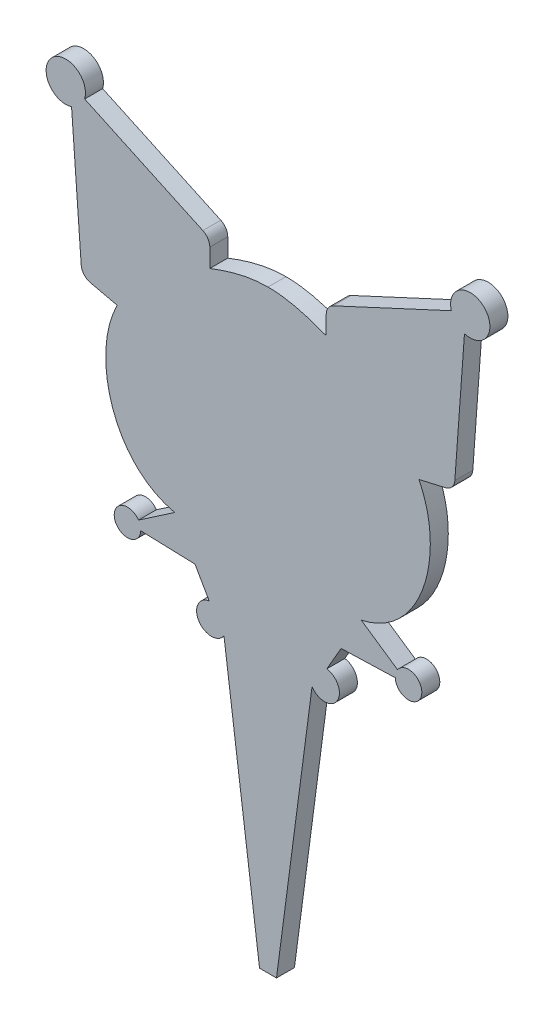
ISO-10303-21;
HEADER;
FILE_DESCRIPTION(('STEP AP214'),'2;1');
FILE_NAME('part.step','',(''),(''),'','','');
FILE_SCHEMA(('AUTOMOTIVE_DESIGN { 1 0 10303 214 1 1 1 1 }'));
ENDSEC;
DATA;
#1=APPLICATION_CONTEXT('core data for automotive mechanical design processes');
#2=APPLICATION_PROTOCOL_DEFINITION('international standard','automotive_design',2000,#1);
#3=PRODUCT_CONTEXT('',#1,'mechanical');
#4=PRODUCT('Part','Part','',(#3));
#5=PRODUCT_RELATED_PRODUCT_CATEGORY('part','',(#4));
#6=PRODUCT_DEFINITION_FORMATION('','',#4);
#7=PRODUCT_DEFINITION_CONTEXT('part definition',#1,'design');
#8=PRODUCT_DEFINITION('design','',#6,#7);
#9=PRODUCT_DEFINITION_SHAPE('','',#8);
#10=(LENGTH_UNIT() NAMED_UNIT(*) SI_UNIT(.MILLI.,.METRE.));
#11=(NAMED_UNIT(*) PLANE_ANGLE_UNIT() SI_UNIT($,.RADIAN.));
#12=(NAMED_UNIT(*) SI_UNIT($,.STERADIAN.) SOLID_ANGLE_UNIT());
#13=UNCERTAINTY_MEASURE_WITH_UNIT(LENGTH_MEASURE(1.E-05),#10,'distance_accuracy_value','');
#14=(GEOMETRIC_REPRESENTATION_CONTEXT(3) GLOBAL_UNCERTAINTY_ASSIGNED_CONTEXT((#13)) GLOBAL_UNIT_ASSIGNED_CONTEXT((#10,
#11,#12)) REPRESENTATION_CONTEXT('',''));
#15=CARTESIAN_POINT('',(0.,0.,0.));
#16=DIRECTION('',(0.,0.,1.));
#17=DIRECTION('',(1.,0.,0.));
#18=AXIS2_PLACEMENT_3D('',#15,#16,#17);
#19=CARTESIAN_POINT('',(108.12807029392,242.914945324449,12.));
#20=DIRECTION('',(0.,0.,-1.));
#21=DIRECTION('',(-1.,0.,0.));
#22=AXIS2_PLACEMENT_3D('',#19,#20,#21);
#23=CYLINDRICAL_SURFACE('',#22,8.);
#24=CARTESIAN_POINT('',(108.12807029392,242.914945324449,0.));
#25=DIRECTION('',(0.,0.,1.));
#26=DIRECTION('',(1.,0.,0.));
#27=AXIS2_PLACEMENT_3D('',#24,#25,#26);
#28=CIRCLE('',#27,8.);
#29=CARTESIAN_POINT('',(116.12807029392,242.914945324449,0.));
#30=VERTEX_POINT('',#29);
#31=CARTESIAN_POINT('',(111.496400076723,250.171277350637,0.));
#32=VERTEX_POINT('',#31);
#33=EDGE_CURVE('E292',#30,#32,#28,.T.);
#34=ORIENTED_EDGE('',*,*,#33,.T.);
#35=DIRECTION('',(0.,0.,-1.));
#36=VECTOR('',#35,1.);
#37=CARTESIAN_POINT('',(111.496400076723,250.171277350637,12.));
#38=LINE('',#37,#36);
#39=CARTESIAN_POINT('',(111.496400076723,250.171277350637,12.));
#40=VERTEX_POINT('',#39);
#41=EDGE_CURVE('E11',#40,#32,#38,.T.);
#42=ORIENTED_EDGE('',*,*,#41,.F.);
#43=CARTESIAN_POINT('',(108.12807029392,242.914945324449,12.));
#44=DIRECTION('',(0.,0.,1.));
#45=DIRECTION('',(1.,0.,0.));
#46=AXIS2_PLACEMENT_3D('',#43,#44,#45);
#47=CIRCLE('',#46,8.);
#48=CARTESIAN_POINT('',(116.12807029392,242.914945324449,12.));
#49=VERTEX_POINT('',#48);
#50=EDGE_CURVE('E293',#49,#40,#47,.T.);
#51=ORIENTED_EDGE('',*,*,#50,.F.);
#52=DIRECTION('',(0.,0.,-1.));
#53=VECTOR('',#52,1.);
#54=CARTESIAN_POINT('',(116.12807029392,242.914945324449,12.));
#55=LINE('',#54,#53);
#56=EDGE_CURVE('E471',#49,#30,#55,.T.);
#57=ORIENTED_EDGE('',*,*,#56,.T.);
#58=EDGE_LOOP('',(#34,#42,#51,#57));
#59=FACE_BOUND('',#58,.T.);
#60=ADVANCED_FACE('F45',(#59),#23,.T.);
#61=CARTESIAN_POINT('',(32.5783061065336,286.804408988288,12.));
#62=DIRECTION('',(-0.421041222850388,-0.907041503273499,0.));
#63=DIRECTION('',(0.9070415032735,-0.421041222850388,0.));
#64=AXIS2_PLACEMENT_3D('',#61,#62,#63);
#65=PLANE('',#64);
#66=DIRECTION('',(-0.9070415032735,0.421041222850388,0.));
#67=VECTOR('',#66,1.);
#68=CARTESIAN_POINT('',(32.5783061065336,286.804408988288,0.));
#69=LINE('',#68,#67);
#70=CARTESIAN_POINT('',(32.5783061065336,286.804408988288,0.));
#71=VERTEX_POINT('',#70);
#72=EDGE_CURVE('E355',#32,#71,#69,.T.);
#73=ORIENTED_EDGE('',*,*,#72,.T.);
#74=DIRECTION('',(0.,0.,-1.));
#75=VECTOR('',#74,1.);
#76=CARTESIAN_POINT('',(32.5783061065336,286.804408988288,12.));
#77=LINE('',#76,#75);
#78=CARTESIAN_POINT('',(32.5783061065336,286.804408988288,12.));
#79=VERTEX_POINT('',#78);
#80=EDGE_CURVE('E53',#79,#71,#77,.T.);
#81=ORIENTED_EDGE('',*,*,#80,.F.);
#82=DIRECTION('',(-0.9070415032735,0.421041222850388,0.));
#83=VECTOR('',#82,1.);
#84=CARTESIAN_POINT('',(32.5783061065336,286.804408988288,12.));
#85=LINE('',#84,#83);
#86=EDGE_CURVE('E297',#40,#79,#85,.T.);
#87=ORIENTED_EDGE('',*,*,#86,.F.);
#88=ORIENTED_EDGE('',*,*,#41,.T.);
#89=EDGE_LOOP('',(#73,#81,#87,#88));
#90=FACE_BOUND('',#89,.T.);
#91=ADVANCED_FACE('F346',(#90),#65,.F.);
#92=CARTESIAN_POINT('',(19.9741027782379,290.474625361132,12.));
#93=DIRECTION('',(0.,0.,-1.));
#94=DIRECTION('',(-1.,0.,0.));
#95=AXIS2_PLACEMENT_3D('',#92,#93,#94);
#96=CYLINDRICAL_SURFACE('',#95,13.1276970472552);
#97=CARTESIAN_POINT('',(19.9741027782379,290.474625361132,0.));
#98=DIRECTION('',(0.,0.,1.));
#99=DIRECTION('',(1.,0.,0.));
#100=AXIS2_PLACEMENT_3D('',#97,#98,#99);
#101=CIRCLE('',#100,13.1276970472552);
#102=CARTESIAN_POINT('',(23.8301965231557,277.926040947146,0.));
#103=VERTEX_POINT('',#102);
#104=EDGE_CURVE('E364',#71,#103,#101,.T.);
#105=ORIENTED_EDGE('',*,*,#104,.T.);
#106=DIRECTION('',(0.,0.,-1.));
#107=VECTOR('',#106,1.);
#108=CARTESIAN_POINT('',(23.8301965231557,277.926040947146,12.));
#109=LINE('',#108,#107);
#110=CARTESIAN_POINT('',(23.8301965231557,277.926040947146,12.));
#111=VERTEX_POINT('',#110);
#112=EDGE_CURVE('E369',#111,#103,#109,.T.);
#113=ORIENTED_EDGE('',*,*,#112,.F.);
#114=CARTESIAN_POINT('',(19.9741027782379,290.474625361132,12.));
#115=DIRECTION('',(0.,0.,1.));
#116=DIRECTION('',(1.,0.,0.));
#117=AXIS2_PLACEMENT_3D('',#114,#115,#116);
#118=CIRCLE('',#117,13.1276970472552);
#119=EDGE_CURVE('E301',#79,#111,#118,.T.);
#120=ORIENTED_EDGE('',*,*,#119,.F.);
#121=ORIENTED_EDGE('',*,*,#80,.T.);
#122=EDGE_LOOP('',(#105,#113,#120,#121));
#123=FACE_BOUND('',#122,.T.);
#124=ADVANCED_FACE('F343',(#123),#96,.T.);
#125=CARTESIAN_POINT('',(23.8301965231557,277.926040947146,12.));
#126=DIRECTION('',(0.997351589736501,0.0727310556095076,0.));
#127=DIRECTION('',(-0.0727310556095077,0.997351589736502,0.));
#128=AXIS2_PLACEMENT_3D('',#125,#126,#127);
#129=PLANE('',#128);
#130=DIRECTION('',(0.0727310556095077,-0.997351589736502,0.));
#131=VECTOR('',#130,1.);
#132=CARTESIAN_POINT('',(23.8301965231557,277.926040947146,0.));
#133=LINE('',#132,#131);
#134=CARTESIAN_POINT('',(30.2646972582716,189.690561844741,0.));
#135=VERTEX_POINT('',#134);
#136=EDGE_CURVE('E373',#103,#135,#133,.T.);
#137=ORIENTED_EDGE('',*,*,#136,.T.);
#138=DIRECTION('',(0.,0.,-1.));
#139=VECTOR('',#138,1.);
#140=CARTESIAN_POINT('',(30.2646972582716,189.690561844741,12.));
#141=LINE('',#140,#139);
#142=CARTESIAN_POINT('',(30.2646972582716,189.690561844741,12.));
#143=VERTEX_POINT('',#142);
#144=EDGE_CURVE('E564',#143,#135,#141,.T.);
#145=ORIENTED_EDGE('',*,*,#144,.F.);
#146=DIRECTION('',(0.0727310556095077,-0.997351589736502,0.));
#147=VECTOR('',#146,1.);
#148=CARTESIAN_POINT('',(23.8301965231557,277.926040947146,12.));
#149=LINE('',#148,#147);
#150=EDGE_CURVE('E304',#111,#143,#149,.T.);
#151=ORIENTED_EDGE('',*,*,#150,.F.);
#152=ORIENTED_EDGE('',*,*,#112,.T.);
#153=EDGE_LOOP('',(#137,#145,#151,#152));
#154=FACE_BOUND('',#153,.T.);
#155=ADVANCED_FACE('F339',(#154),#129,.F.);
#156=CARTESIAN_POINT('',(38.2435099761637,190.272410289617,12.));
#157=DIRECTION('',(0.,0.,-1.));
#158=DIRECTION('',(-1.,0.,0.));
#159=AXIS2_PLACEMENT_3D('',#156,#157,#158);
#160=CYLINDRICAL_SURFACE('',#159,8.);
#161=CARTESIAN_POINT('',(38.2435099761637,190.272410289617,0.));
#162=DIRECTION('',(0.,0.,1.));
#163=DIRECTION('',(1.,0.,0.));
#164=AXIS2_PLACEMENT_3D('',#161,#162,#163);
#165=CIRCLE('',#164,8.);
#166=CARTESIAN_POINT('',(36.4555176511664,182.47477709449,0.));
#167=VERTEX_POINT('',#166);
#168=EDGE_CURVE('E377',#135,#167,#165,.T.);
#169=ORIENTED_EDGE('',*,*,#168,.T.);
#170=DIRECTION('',(0.,0.,-1.));
#171=VECTOR('',#170,1.);
#172=CARTESIAN_POINT('',(36.4555176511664,182.47477709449,12.));
#173=LINE('',#172,#171);
#174=CARTESIAN_POINT('',(36.4555176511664,182.47477709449,12.));
#175=VERTEX_POINT('',#174);
#176=EDGE_CURVE('E560',#175,#167,#173,.T.);
#177=ORIENTED_EDGE('',*,*,#176,.F.);
#178=CARTESIAN_POINT('',(38.2435099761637,190.272410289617,12.));
#179=DIRECTION('',(0.,0.,1.));
#180=DIRECTION('',(1.,0.,0.));
#181=AXIS2_PLACEMENT_3D('',#178,#179,#180);
#182=CIRCLE('',#181,8.);
#183=EDGE_CURVE('E307',#143,#175,#182,.T.);
#184=ORIENTED_EDGE('',*,*,#183,.F.);
#185=ORIENTED_EDGE('',*,*,#144,.T.);
#186=EDGE_LOOP('',(#169,#177,#184,#185));
#187=FACE_BOUND('',#186,.T.);
#188=ADVANCED_FACE('F335',(#187),#160,.T.);
#189=CARTESIAN_POINT('',(36.4555176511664,182.47477709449,12.));
#190=DIRECTION('',(0.223499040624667,0.974704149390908,0.));
#191=DIRECTION('',(-0.974704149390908,0.223499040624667,0.));
#192=AXIS2_PLACEMENT_3D('',#189,#190,#191);
#193=PLANE('',#192);
#194=DIRECTION('',(0.974704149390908,-0.223499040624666,0.));
#195=VECTOR('',#194,1.);
#196=CARTESIAN_POINT('',(36.4555176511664,182.47477709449,0.));
#197=LINE('',#196,#195);
#198=CARTESIAN_POINT('',(54.3091121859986,178.380959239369,0.));
#199=VERTEX_POINT('',#198);
#200=EDGE_CURVE('E383',#167,#199,#197,.T.);
#201=ORIENTED_EDGE('',*,*,#200,.T.);
#202=DIRECTION('',(0.,0.,-1.));
#203=VECTOR('',#202,1.);
#204=CARTESIAN_POINT('',(54.3091121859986,178.380959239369,12.));
#205=LINE('',#204,#203);
#206=CARTESIAN_POINT('',(54.3091121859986,178.380959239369,12.));
#207=VERTEX_POINT('',#206);
#208=EDGE_CURVE('E556',#207,#199,#205,.T.);
#209=ORIENTED_EDGE('',*,*,#208,.F.);
#210=DIRECTION('',(0.974704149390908,-0.223499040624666,0.));
#211=VECTOR('',#210,1.);
#212=CARTESIAN_POINT('',(36.4555176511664,182.47477709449,12.));
#213=LINE('',#212,#211);
#214=EDGE_CURVE('E310',#175,#207,#213,.T.);
#215=ORIENTED_EDGE('',*,*,#214,.F.);
#216=ORIENTED_EDGE('',*,*,#176,.T.);
#217=EDGE_LOOP('',(#201,#209,#215,#216));
#218=FACE_BOUND('',#217,.T.);
#219=ADVANCED_FACE('F330',(#218),#193,.F.);
#220=CARTESIAN_POINT('',(54.3091121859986,178.380959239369,12.));
#221=CARTESIAN_POINT('',(36.2060877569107,143.483509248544,12.));
#222=CARTESIAN_POINT('',(50.5640378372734,86.9134129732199,12.));
#223=CARTESIAN_POINT('',(92.7637020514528,77.8061877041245,12.));
#224=B_SPLINE_CURVE_WITH_KNOTS('',3,(#220,#221,#222,#223),.UNSPECIFIED.,.F.,.F.,(4,4),(0.,1.),.UNSPECIFIED.);
#225=DIRECTION('',(0.,0.,-1.));
#226=VECTOR('',#225,1.);
#227=SURFACE_OF_LINEAR_EXTRUSION('',#224,#226);
#228=CARTESIAN_POINT('',(54.3091121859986,178.380959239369,0.));
#229=CARTESIAN_POINT('',(36.2060877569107,143.483509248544,0.));
#230=CARTESIAN_POINT('',(50.5640378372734,86.9134129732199,0.));
#231=CARTESIAN_POINT('',(92.7637020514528,77.8061877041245,0.));
#232=B_SPLINE_CURVE_WITH_KNOTS('',3,(#228,#229,#230,#231),.UNSPECIFIED.,.F.,.F.,(4,4),(0.,1.),.UNSPECIFIED.);
#233=CARTESIAN_POINT('',(92.7637020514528,77.8061877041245,0.));
#234=VERTEX_POINT('',#233);
#235=EDGE_CURVE('E386',#199,#234,#232,.T.);
#236=ORIENTED_EDGE('',*,*,#235,.T.);
#237=DIRECTION('',(0.,0.,-1.));
#238=VECTOR('',#237,1.);
#239=CARTESIAN_POINT('',(92.7637020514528,77.8061877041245,12.));
#240=LINE('',#239,#238);
#241=CARTESIAN_POINT('',(92.7637020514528,77.8061877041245,12.));
#242=VERTEX_POINT('',#241);
#243=EDGE_CURVE('E552',#242,#234,#240,.T.);
#244=ORIENTED_EDGE('',*,*,#243,.F.);
#245=EDGE_CURVE('E313',#207,#242,#224,.T.);
#246=ORIENTED_EDGE('',*,*,#245,.F.);
#247=ORIENTED_EDGE('',*,*,#208,.T.);
#248=EDGE_LOOP('',(#236,#244,#246,#247));
#249=FACE_BOUND('',#248,.T.);
#250=ADVANCED_FACE('F325',(#249),#227,.F.);
#251=CARTESIAN_POINT('',(68.4935491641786,61.2549578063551,12.));
#252=DIRECTION('',(0.563415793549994,-0.826173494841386,0.));
#253=DIRECTION('',(0.826173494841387,0.563415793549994,0.));
#254=AXIS2_PLACEMENT_3D('',#251,#252,#253);
#255=PLANE('',#254);
#256=DIRECTION('',(-0.826173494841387,-0.563415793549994,0.));
#257=VECTOR('',#256,1.);
#258=CARTESIAN_POINT('',(68.4935491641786,61.2549578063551,0.));
#259=LINE('',#258,#257);
#260=CARTESIAN_POINT('',(68.4935491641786,61.2549578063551,0.));
#261=VERTEX_POINT('',#260);
#262=EDGE_CURVE('E391',#234,#261,#259,.T.);
#263=ORIENTED_EDGE('',*,*,#262,.T.);
#264=DIRECTION('',(0.,0.,-1.));
#265=VECTOR('',#264,1.);
#266=CARTESIAN_POINT('',(68.4935491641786,61.2549578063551,12.));
#267=LINE('',#266,#265);
#268=CARTESIAN_POINT('',(68.4935491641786,61.2549578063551,12.));
#269=VERTEX_POINT('',#268);
#270=EDGE_CURVE('E548',#269,#261,#267,.T.);
#271=ORIENTED_EDGE('',*,*,#270,.F.);
#272=DIRECTION('',(-0.826173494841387,-0.563415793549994,0.));
#273=VECTOR('',#272,1.);
#274=CARTESIAN_POINT('',(68.4935491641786,61.2549578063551,12.));
#275=LINE('',#274,#273);
#276=EDGE_CURVE('E319',#242,#269,#275,.T.);
#277=ORIENTED_EDGE('',*,*,#276,.F.);
#278=ORIENTED_EDGE('',*,*,#243,.T.);
#279=EDGE_LOOP('',(#263,#271,#277,#278));
#280=FACE_BOUND('',#279,.T.);
#281=ADVANCED_FACE('F329',(#280),#255,.F.);
#282=CARTESIAN_POINT('',(61.1689149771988,56.2561925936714,12.));
#283=DIRECTION('',(0.,0.,-1.));
#284=DIRECTION('',(-1.,0.,0.));
#285=AXIS2_PLACEMENT_3D('',#282,#283,#284);
#286=CYLINDRICAL_SURFACE('',#285,8.86780241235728);
#287=CARTESIAN_POINT('',(61.1689149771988,56.2561925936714,0.));
#288=DIRECTION('',(0.,0.,1.));
#289=DIRECTION('',(1.,0.,0.));
#290=AXIS2_PLACEMENT_3D('',#287,#288,#289);
#291=CIRCLE('',#290,8.86780241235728);
#292=CARTESIAN_POINT('',(70.0266573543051,55.8339135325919,0.));
#293=VERTEX_POINT('',#292);
#294=EDGE_CURVE('E397',#261,#293,#291,.T.);
#295=ORIENTED_EDGE('',*,*,#294,.T.);
#296=DIRECTION('',(0.,0.,-1.));
#297=VECTOR('',#296,1.);
#298=CARTESIAN_POINT('',(70.0266573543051,55.8339135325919,12.));
#299=LINE('',#298,#297);
#300=CARTESIAN_POINT('',(70.0266573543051,55.8339135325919,12.));
#301=VERTEX_POINT('',#300);
#302=EDGE_CURVE('E544',#301,#293,#299,.T.);
#303=ORIENTED_EDGE('',*,*,#302,.F.);
#304=CARTESIAN_POINT('',(61.1689149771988,56.2561925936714,12.));
#305=DIRECTION('',(0.,0.,1.));
#306=DIRECTION('',(1.,0.,0.));
#307=AXIS2_PLACEMENT_3D('',#304,#305,#306);
#308=CIRCLE('',#307,8.86780241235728);
#309=EDGE_CURVE('E756',#269,#301,#308,.T.);
#310=ORIENTED_EDGE('',*,*,#309,.F.);
#311=ORIENTED_EDGE('',*,*,#270,.T.);
#312=EDGE_LOOP('',(#295,#303,#310,#311));
#313=FACE_BOUND('',#312,.T.);
#314=ADVANCED_FACE('F753',(#313),#286,.T.);
#315=CARTESIAN_POINT('',(70.0266573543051,55.8339135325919,12.));
#316=DIRECTION('',(0.0316289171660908,0.999499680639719,0.));
#317=DIRECTION('',(-0.999499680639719,0.0316289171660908,0.));
#318=AXIS2_PLACEMENT_3D('',#315,#316,#317);
#319=PLANE('',#318);
#320=DIRECTION('',(0.999499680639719,-0.0316289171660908,0.));
#321=VECTOR('',#320,1.);
#322=CARTESIAN_POINT('',(70.0266573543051,55.8339135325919,0.));
#323=LINE('',#322,#321);
#324=CARTESIAN_POINT('',(106.214537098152,54.6887571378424,0.));
#325=VERTEX_POINT('',#324);
#326=EDGE_CURVE('E400',#293,#325,#323,.T.);
#327=ORIENTED_EDGE('',*,*,#326,.T.);
#328=DIRECTION('',(0.,0.,-1.));
#329=VECTOR('',#328,1.);
#330=CARTESIAN_POINT('',(106.214537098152,54.6887571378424,12.));
#331=LINE('',#330,#329);
#332=CARTESIAN_POINT('',(106.214537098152,54.6887571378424,12.));
#333=VERTEX_POINT('',#332);
#334=EDGE_CURVE('E540',#333,#325,#331,.T.);
#335=ORIENTED_EDGE('',*,*,#334,.F.);
#336=DIRECTION('',(0.999499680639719,-0.0316289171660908,0.));
#337=VECTOR('',#336,1.);
#338=CARTESIAN_POINT('',(70.0266573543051,55.8339135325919,12.));
#339=LINE('',#338,#337);
#340=EDGE_CURVE('E747',#301,#333,#339,.T.);
#341=ORIENTED_EDGE('',*,*,#340,.F.);
#342=ORIENTED_EDGE('',*,*,#302,.T.);
#343=EDGE_LOOP('',(#327,#335,#341,#342));
#344=FACE_BOUND('',#343,.T.);
#345=ADVANCED_FACE('F746',(#344),#319,.F.);
#346=CARTESIAN_POINT('',(106.214537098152,54.6887571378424,12.));
#347=DIRECTION('',(0.86706573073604,0.498193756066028,0.));
#348=DIRECTION('',(-0.498193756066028,0.86706573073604,0.));
#349=AXIS2_PLACEMENT_3D('',#346,#347,#348);
#350=PLANE('',#349);
#351=DIRECTION('',(0.498193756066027,-0.86706573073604,0.));
#352=VECTOR('',#351,1.);
#353=CARTESIAN_POINT('',(106.214537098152,54.6887571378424,0.));
#354=LINE('',#353,#352);
#355=CARTESIAN_POINT('',(115.72503704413,38.1365051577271,0.));
#356=VERTEX_POINT('',#355);
#357=EDGE_CURVE('E403',#325,#356,#354,.T.);
#358=ORIENTED_EDGE('',*,*,#357,.T.);
#359=DIRECTION('',(0.,0.,-1.));
#360=VECTOR('',#359,1.);
#361=CARTESIAN_POINT('',(115.72503704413,38.1365051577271,12.));
#362=LINE('',#361,#360);
#363=CARTESIAN_POINT('',(115.72503704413,38.1365051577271,12.));
#364=VERTEX_POINT('',#363);
#365=EDGE_CURVE('E536',#364,#356,#362,.T.);
#366=ORIENTED_EDGE('',*,*,#365,.F.);
#367=DIRECTION('',(0.498193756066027,-0.86706573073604,0.));
#368=VECTOR('',#367,1.);
#369=CARTESIAN_POINT('',(106.214537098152,54.6887571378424,12.));
#370=LINE('',#369,#368);
#371=EDGE_CURVE('E742',#333,#364,#370,.T.);
#372=ORIENTED_EDGE('',*,*,#371,.F.);
#373=ORIENTED_EDGE('',*,*,#334,.T.);
#374=EDGE_LOOP('',(#358,#366,#372,#373));
#375=FACE_BOUND('',#374,.T.);
#376=ADVANCED_FACE('F741',(#375),#350,.F.);
#377=CARTESIAN_POINT('',(117.253821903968,28.3215947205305,12.));
#378=DIRECTION('',(0.,0.,-1.));
#379=DIRECTION('',(-1.,0.,0.));
#380=AXIS2_PLACEMENT_3D('',#377,#378,#379);
#381=CYLINDRICAL_SURFACE('',#380,9.93325978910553);
#382=CARTESIAN_POINT('',(117.253821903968,28.3215947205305,0.));
#383=DIRECTION('',(0.,0.,1.));
#384=DIRECTION('',(1.,0.,0.));
#385=AXIS2_PLACEMENT_3D('',#382,#383,#384);
#386=CIRCLE('',#385,9.93325978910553);
#387=CARTESIAN_POINT('',(125.599575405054,22.93475440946,0.));
#388=VERTEX_POINT('',#387);
#389=EDGE_CURVE('E406',#356,#388,#386,.T.);
#390=ORIENTED_EDGE('',*,*,#389,.T.);
#391=DIRECTION('',(0.,0.,-1.));
#392=VECTOR('',#391,1.);
#393=CARTESIAN_POINT('',(125.599575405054,22.93475440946,12.));
#394=LINE('',#393,#392);
#395=CARTESIAN_POINT('',(125.599575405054,22.93475440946,12.));
#396=VERTEX_POINT('',#395);
#397=EDGE_CURVE('E68',#388,#396,#394,.F.);
#398=ORIENTED_EDGE('',*,*,#397,.T.);
#399=CARTESIAN_POINT('',(117.253821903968,28.3215947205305,12.));
#400=DIRECTION('',(0.,0.,1.));
#401=DIRECTION('',(1.,0.,0.));
#402=AXIS2_PLACEMENT_3D('',#399,#400,#401);
#403=CIRCLE('',#402,9.93325978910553);
#404=EDGE_CURVE('E256',#364,#396,#403,.T.);
#405=ORIENTED_EDGE('',*,*,#404,.F.);
#406=ORIENTED_EDGE('',*,*,#365,.T.);
#407=EDGE_LOOP('',(#390,#398,#405,#406));
#408=FACE_BOUND('',#407,.T.);
#409=ADVANCED_FACE('F737',(#408),#381,.T.);
#410=CARTESIAN_POINT('',(192.746178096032,28.3215947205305,12.));
#411=DIRECTION('',(0.,0.,-1.));
#412=DIRECTION('',(-1.,0.,0.));
#413=AXIS2_PLACEMENT_3D('',#410,#411,#412);
#414=CYLINDRICAL_SURFACE('',#413,9.93325978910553);
#415=CARTESIAN_POINT('',(192.746178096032,28.3215947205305,12.));
#416=DIRECTION('',(0.,0.,1.));
#417=DIRECTION('',(-1.,0.,0.));
#418=AXIS2_PLACEMENT_3D('',#415,#416,#417);
#419=CIRCLE('',#418,9.93325978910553);
#420=CARTESIAN_POINT('',(184.400424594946,22.93475440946,12.));
#421=VERTEX_POINT('',#420);
#422=CARTESIAN_POINT('',(194.27496295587,38.1365051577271,12.));
#423=VERTEX_POINT('',#422);
#424=EDGE_CURVE('E60',#421,#423,#419,.T.);
#425=ORIENTED_EDGE('',*,*,#424,.F.);
#426=DIRECTION('',(0.,0.,-1.));
#427=VECTOR('',#426,1.);
#428=CARTESIAN_POINT('',(184.400424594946,22.93475440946,12.));
#429=LINE('',#428,#427);
#430=CARTESIAN_POINT('',(184.400424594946,22.93475440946,0.));
#431=VERTEX_POINT('',#430);
#432=EDGE_CURVE('E289',#421,#431,#429,.T.);
#433=ORIENTED_EDGE('',*,*,#432,.T.);
#434=CARTESIAN_POINT('',(192.746178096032,28.3215947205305,0.));
#435=DIRECTION('',(0.,0.,1.));
#436=DIRECTION('',(-1.,0.,0.));
#437=AXIS2_PLACEMENT_3D('',#434,#435,#436);
#438=CIRCLE('',#437,9.93325978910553);
#439=CARTESIAN_POINT('',(194.27496295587,38.1365051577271,0.));
#440=VERTEX_POINT('',#439);
#441=EDGE_CURVE('E409',#431,#440,#438,.T.);
#442=ORIENTED_EDGE('',*,*,#441,.T.);
#443=DIRECTION('',(0.,0.,-1.));
#444=VECTOR('',#443,1.);
#445=CARTESIAN_POINT('',(194.27496295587,38.1365051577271,12.));
#446=LINE('',#445,#444);
#447=EDGE_CURVE('E532',#423,#440,#446,.T.);
#448=ORIENTED_EDGE('',*,*,#447,.F.);
#449=EDGE_LOOP('',(#425,#433,#442,#448));
#450=FACE_BOUND('',#449,.T.);
#451=ADVANCED_FACE('F728',(#450),#414,.T.);
#452=CARTESIAN_POINT('',(203.785462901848,54.6887571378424,12.));
#453=DIRECTION('',(-0.867065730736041,0.498193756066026,0.));
#454=DIRECTION('',(-0.498193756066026,-0.867065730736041,0.));
#455=AXIS2_PLACEMENT_3D('',#452,#453,#454);
#456=PLANE('',#455);
#457=DIRECTION('',(0.498193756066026,0.867065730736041,0.));
#458=VECTOR('',#457,1.);
#459=CARTESIAN_POINT('',(203.785462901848,54.6887571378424,0.));
#460=LINE('',#459,#458);
#461=CARTESIAN_POINT('',(203.785462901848,54.6887571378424,0.));
#462=VERTEX_POINT('',#461);
#463=EDGE_CURVE('E412',#440,#462,#460,.T.);
#464=ORIENTED_EDGE('',*,*,#463,.T.);
#465=DIRECTION('',(0.,0.,-1.));
#466=VECTOR('',#465,1.);
#467=CARTESIAN_POINT('',(203.785462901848,54.6887571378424,12.));
#468=LINE('',#467,#466);
#469=CARTESIAN_POINT('',(203.785462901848,54.6887571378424,12.));
#470=VERTEX_POINT('',#469);
#471=EDGE_CURVE('E528',#470,#462,#468,.T.);
#472=ORIENTED_EDGE('',*,*,#471,.F.);
#473=DIRECTION('',(0.498193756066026,0.867065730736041,0.));
#474=VECTOR('',#473,1.);
#475=CARTESIAN_POINT('',(203.785462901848,54.6887571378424,12.));
#476=LINE('',#475,#474);
#477=EDGE_CURVE('E726',#423,#470,#476,.T.);
#478=ORIENTED_EDGE('',*,*,#477,.F.);
#479=ORIENTED_EDGE('',*,*,#447,.T.);
#480=EDGE_LOOP('',(#464,#472,#478,#479));
#481=FACE_BOUND('',#480,.T.);
#482=ADVANCED_FACE('F725',(#481),#456,.F.);
#483=CARTESIAN_POINT('',(239.973342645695,55.8339135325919,12.));
#484=DIRECTION('',(-0.0316289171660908,0.999499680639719,0.));
#485=DIRECTION('',(-0.999499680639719,-0.0316289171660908,0.));
#486=AXIS2_PLACEMENT_3D('',#483,#484,#485);
#487=PLANE('',#486);
#488=DIRECTION('',(0.999499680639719,0.0316289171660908,0.));
#489=VECTOR('',#488,1.);
#490=CARTESIAN_POINT('',(239.973342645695,55.8339135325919,0.));
#491=LINE('',#490,#489);
#492=CARTESIAN_POINT('',(239.973342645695,55.8339135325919,0.));
#493=VERTEX_POINT('',#492);
#494=EDGE_CURVE('E415',#462,#493,#491,.T.);
#495=ORIENTED_EDGE('',*,*,#494,.T.);
#496=DIRECTION('',(0.,0.,-1.));
#497=VECTOR('',#496,1.);
#498=CARTESIAN_POINT('',(239.973342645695,55.8339135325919,12.));
#499=LINE('',#498,#497);
#500=CARTESIAN_POINT('',(239.973342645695,55.8339135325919,12.));
#501=VERTEX_POINT('',#500);
#502=EDGE_CURVE('E524',#501,#493,#499,.T.);
#503=ORIENTED_EDGE('',*,*,#502,.F.);
#504=DIRECTION('',(0.999499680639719,0.0316289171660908,0.));
#505=VECTOR('',#504,1.);
#506=CARTESIAN_POINT('',(239.973342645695,55.8339135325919,12.));
#507=LINE('',#506,#505);
#508=EDGE_CURVE('E721',#470,#501,#507,.T.);
#509=ORIENTED_EDGE('',*,*,#508,.F.);
#510=ORIENTED_EDGE('',*,*,#471,.T.);
#511=EDGE_LOOP('',(#495,#503,#509,#510));
#512=FACE_BOUND('',#511,.T.);
#513=ADVANCED_FACE('F720',(#512),#487,.F.);
#514=CARTESIAN_POINT('',(248.831085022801,56.2561925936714,12.));
#515=DIRECTION('',(0.,0.,-1.));
#516=DIRECTION('',(-1.,0.,0.));
#517=AXIS2_PLACEMENT_3D('',#514,#515,#516);
#518=CYLINDRICAL_SURFACE('',#517,8.86780241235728);
#519=CARTESIAN_POINT('',(248.831085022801,56.2561925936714,0.));
#520=DIRECTION('',(0.,0.,1.));
#521=DIRECTION('',(-1.,0.,0.));
#522=AXIS2_PLACEMENT_3D('',#519,#520,#521);
#523=CIRCLE('',#522,8.86780241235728);
#524=CARTESIAN_POINT('',(241.506450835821,61.2549578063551,0.));
#525=VERTEX_POINT('',#524);
#526=EDGE_CURVE('E418',#493,#525,#523,.T.);
#527=ORIENTED_EDGE('',*,*,#526,.T.);
#528=DIRECTION('',(0.,0.,-1.));
#529=VECTOR('',#528,1.);
#530=CARTESIAN_POINT('',(241.506450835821,61.2549578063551,12.));
#531=LINE('',#530,#529);
#532=CARTESIAN_POINT('',(241.506450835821,61.2549578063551,12.));
#533=VERTEX_POINT('',#532);
#534=EDGE_CURVE('E520',#533,#525,#531,.T.);
#535=ORIENTED_EDGE('',*,*,#534,.F.);
#536=CARTESIAN_POINT('',(248.831085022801,56.2561925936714,12.));
#537=DIRECTION('',(0.,0.,1.));
#538=DIRECTION('',(-1.,0.,0.));
#539=AXIS2_PLACEMENT_3D('',#536,#537,#538);
#540=CIRCLE('',#539,8.86780241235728);
#541=EDGE_CURVE('E717',#501,#533,#540,.T.);
#542=ORIENTED_EDGE('',*,*,#541,.F.);
#543=ORIENTED_EDGE('',*,*,#502,.T.);
#544=EDGE_LOOP('',(#527,#535,#542,#543));
#545=FACE_BOUND('',#544,.T.);
#546=ADVANCED_FACE('F714',(#545),#518,.T.);
#547=CARTESIAN_POINT('',(241.506450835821,61.2549578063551,12.));
#548=DIRECTION('',(-0.563415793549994,-0.826173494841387,0.));
#549=DIRECTION('',(0.826173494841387,-0.563415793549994,0.));
#550=AXIS2_PLACEMENT_3D('',#547,#548,#549);
#551=PLANE('',#550);
#552=DIRECTION('',(-0.826173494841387,0.563415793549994,0.));
#553=VECTOR('',#552,1.);
#554=CARTESIAN_POINT('',(241.506450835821,61.2549578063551,0.));
#555=LINE('',#554,#553);
#556=CARTESIAN_POINT('',(217.236297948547,77.8061877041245,0.));
#557=VERTEX_POINT('',#556);
#558=EDGE_CURVE('E421',#525,#557,#555,.T.);
#559=ORIENTED_EDGE('',*,*,#558,.T.);
#560=DIRECTION('',(0.,0.,-1.));
#561=VECTOR('',#560,1.);
#562=CARTESIAN_POINT('',(217.236297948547,77.8061877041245,12.));
#563=LINE('',#562,#561);
#564=CARTESIAN_POINT('',(217.236297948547,77.8061877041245,12.));
#565=VERTEX_POINT('',#564);
#566=EDGE_CURVE('E516',#565,#557,#563,.T.);
#567=ORIENTED_EDGE('',*,*,#566,.F.);
#568=DIRECTION('',(-0.826173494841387,0.563415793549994,0.));
#569=VECTOR('',#568,1.);
#570=CARTESIAN_POINT('',(241.506450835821,61.2549578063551,12.));
#571=LINE('',#570,#569);
#572=EDGE_CURVE('E650',#533,#565,#571,.T.);
#573=ORIENTED_EDGE('',*,*,#572,.F.);
#574=ORIENTED_EDGE('',*,*,#534,.T.);
#575=EDGE_LOOP('',(#559,#567,#573,#574));
#576=FACE_BOUND('',#575,.T.);
#577=ADVANCED_FACE('F639',(#576),#551,.F.);
#578=CARTESIAN_POINT('',(217.236297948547,77.8061877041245,12.));
#579=CARTESIAN_POINT('',(259.435962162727,86.9134129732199,12.));
#580=CARTESIAN_POINT('',(273.793912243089,143.483509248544,12.));
#581=CARTESIAN_POINT('',(255.690887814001,178.380959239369,12.));
#582=B_SPLINE_CURVE_WITH_KNOTS('',3,(#578,#579,#580,#581),.UNSPECIFIED.,.F.,.F.,(4,4),(0.,1.),.UNSPECIFIED.);
#583=DIRECTION('',(0.,0.,-1.));
#584=VECTOR('',#583,1.);
#585=SURFACE_OF_LINEAR_EXTRUSION('',#582,#584);
#586=CARTESIAN_POINT('',(217.236297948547,77.8061877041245,0.));
#587=CARTESIAN_POINT('',(259.435962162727,86.9134129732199,0.));
#588=CARTESIAN_POINT('',(273.793912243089,143.483509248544,0.));
#589=CARTESIAN_POINT('',(255.690887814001,178.380959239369,0.));
#590=B_SPLINE_CURVE_WITH_KNOTS('',3,(#586,#587,#588,#589),.UNSPECIFIED.,.F.,.F.,(4,4),(0.,1.),.UNSPECIFIED.);
#591=CARTESIAN_POINT('',(255.690887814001,178.380959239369,0.));
#592=VERTEX_POINT('',#591);
#593=EDGE_CURVE('E424',#557,#592,#590,.T.);
#594=ORIENTED_EDGE('',*,*,#593,.T.);
#595=DIRECTION('',(0.,0.,-1.));
#596=VECTOR('',#595,1.);
#597=CARTESIAN_POINT('',(255.690887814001,178.380959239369,12.));
#598=LINE('',#597,#596);
#599=CARTESIAN_POINT('',(255.690887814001,178.380959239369,12.));
#600=VERTEX_POINT('',#599);
#601=EDGE_CURVE('E512',#600,#592,#598,.T.);
#602=ORIENTED_EDGE('',*,*,#601,.F.);
#603=EDGE_CURVE('E642',#565,#600,#582,.T.);
#604=ORIENTED_EDGE('',*,*,#603,.F.);
#605=ORIENTED_EDGE('',*,*,#566,.T.);
#606=EDGE_LOOP('',(#594,#602,#604,#605));
#607=FACE_BOUND('',#606,.T.);
#608=ADVANCED_FACE('F634',(#607),#585,.F.);
#609=CARTESIAN_POINT('',(273.544482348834,182.47477709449,12.));
#610=DIRECTION('',(-0.223499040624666,0.974704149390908,0.));
#611=DIRECTION('',(-0.974704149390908,-0.223499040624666,0.));
#612=AXIS2_PLACEMENT_3D('',#609,#610,#611);
#613=PLANE('',#612);
#614=DIRECTION('',(0.974704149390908,0.223499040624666,0.));
#615=VECTOR('',#614,1.);
#616=CARTESIAN_POINT('',(273.544482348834,182.47477709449,0.));
#617=LINE('',#616,#615);
#618=CARTESIAN_POINT('',(273.544482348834,182.47477709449,0.));
#619=VERTEX_POINT('',#618);
#620=EDGE_CURVE('E429',#592,#619,#617,.T.);
#621=ORIENTED_EDGE('',*,*,#620,.T.);
#622=DIRECTION('',(0.,0.,-1.));
#623=VECTOR('',#622,1.);
#624=CARTESIAN_POINT('',(273.544482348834,182.47477709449,12.));
#625=LINE('',#624,#623);
#626=CARTESIAN_POINT('',(273.544482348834,182.47477709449,12.));
#627=VERTEX_POINT('',#626);
#628=EDGE_CURVE('E508',#627,#619,#625,.T.);
#629=ORIENTED_EDGE('',*,*,#628,.F.);
#630=DIRECTION('',(0.974704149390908,0.223499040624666,0.));
#631=VECTOR('',#630,1.);
#632=CARTESIAN_POINT('',(273.544482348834,182.47477709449,12.));
#633=LINE('',#632,#631);
#634=EDGE_CURVE('E649',#600,#627,#633,.T.);
#635=ORIENTED_EDGE('',*,*,#634,.F.);
#636=ORIENTED_EDGE('',*,*,#601,.T.);
#637=EDGE_LOOP('',(#621,#629,#635,#636));
#638=FACE_BOUND('',#637,.T.);
#639=ADVANCED_FACE('F630',(#638),#613,.F.);
#640=CARTESIAN_POINT('',(271.756490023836,190.272410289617,12.));
#641=DIRECTION('',(0.,0.,-1.));
#642=DIRECTION('',(-1.,0.,0.));
#643=AXIS2_PLACEMENT_3D('',#640,#641,#642);
#644=CYLINDRICAL_SURFACE('',#643,8.00000000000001);
#645=CARTESIAN_POINT('',(271.756490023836,190.272410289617,0.));
#646=DIRECTION('',(0.,0.,1.));
#647=DIRECTION('',(-1.,0.,0.));
#648=AXIS2_PLACEMENT_3D('',#645,#646,#647);
#649=CIRCLE('',#648,8.00000000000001);
#650=CARTESIAN_POINT('',(279.735302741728,189.690561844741,0.));
#651=VERTEX_POINT('',#650);
#652=EDGE_CURVE('E435',#619,#651,#649,.T.);
#653=ORIENTED_EDGE('',*,*,#652,.T.);
#654=DIRECTION('',(0.,0.,-1.));
#655=VECTOR('',#654,1.);
#656=CARTESIAN_POINT('',(279.735302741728,189.690561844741,12.));
#657=LINE('',#656,#655);
#658=CARTESIAN_POINT('',(279.735302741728,189.690561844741,12.));
#659=VERTEX_POINT('',#658);
#660=EDGE_CURVE('E504',#659,#651,#657,.T.);
#661=ORIENTED_EDGE('',*,*,#660,.F.);
#662=CARTESIAN_POINT('',(271.756490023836,190.272410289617,12.));
#663=DIRECTION('',(0.,0.,1.));
#664=DIRECTION('',(-1.,0.,0.));
#665=AXIS2_PLACEMENT_3D('',#662,#663,#664);
#666=CIRCLE('',#665,8.00000000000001);
#667=EDGE_CURVE('E657',#627,#659,#666,.T.);
#668=ORIENTED_EDGE('',*,*,#667,.F.);
#669=ORIENTED_EDGE('',*,*,#628,.T.);
#670=EDGE_LOOP('',(#653,#661,#668,#669));
#671=FACE_BOUND('',#670,.T.);
#672=ADVANCED_FACE('F626',(#671),#644,.T.);
#673=CARTESIAN_POINT('',(286.169803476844,277.926040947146,12.));
#674=DIRECTION('',(-0.997351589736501,0.0727310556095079,0.));
#675=DIRECTION('',(-0.0727310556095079,-0.997351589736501,0.));
#676=AXIS2_PLACEMENT_3D('',#673,#674,#675);
#677=PLANE('',#676);
#678=DIRECTION('',(0.0727310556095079,0.997351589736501,0.));
#679=VECTOR('',#678,1.);
#680=CARTESIAN_POINT('',(286.169803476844,277.926040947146,0.));
#681=LINE('',#680,#679);
#682=CARTESIAN_POINT('',(286.169803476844,277.926040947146,0.));
#683=VERTEX_POINT('',#682);
#684=EDGE_CURVE('E438',#651,#683,#681,.T.);
#685=ORIENTED_EDGE('',*,*,#684,.T.);
#686=DIRECTION('',(0.,0.,-1.));
#687=VECTOR('',#686,1.);
#688=CARTESIAN_POINT('',(286.169803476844,277.926040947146,12.));
#689=LINE('',#688,#687);
#690=CARTESIAN_POINT('',(286.169803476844,277.926040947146,12.));
#691=VERTEX_POINT('',#690);
#692=EDGE_CURVE('E500',#691,#683,#689,.T.);
#693=ORIENTED_EDGE('',*,*,#692,.F.);
#694=DIRECTION('',(0.0727310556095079,0.997351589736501,0.));
#695=VECTOR('',#694,1.);
#696=CARTESIAN_POINT('',(286.169803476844,277.926040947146,12.));
#697=LINE('',#696,#695);
#698=EDGE_CURVE('E660',#659,#691,#697,.T.);
#699=ORIENTED_EDGE('',*,*,#698,.F.);
#700=ORIENTED_EDGE('',*,*,#660,.T.);
#701=EDGE_LOOP('',(#685,#693,#699,#700));
#702=FACE_BOUND('',#701,.T.);
#703=ADVANCED_FACE('F622',(#702),#677,.F.);
#704=CARTESIAN_POINT('',(290.025897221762,290.474625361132,12.));
#705=DIRECTION('',(0.,0.,-1.));
#706=DIRECTION('',(-1.,0.,0.));
#707=AXIS2_PLACEMENT_3D('',#704,#705,#706);
#708=CYLINDRICAL_SURFACE('',#707,13.1276970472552);
#709=CARTESIAN_POINT('',(290.025897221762,290.474625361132,0.));
#710=DIRECTION('',(0.,0.,1.));
#711=DIRECTION('',(-1.,0.,0.));
#712=AXIS2_PLACEMENT_3D('',#709,#710,#711);
#713=CIRCLE('',#712,13.1276970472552);
#714=CARTESIAN_POINT('',(277.421693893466,286.804408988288,0.));
#715=VERTEX_POINT('',#714);
#716=EDGE_CURVE('E441',#683,#715,#713,.T.);
#717=ORIENTED_EDGE('',*,*,#716,.T.);
#718=DIRECTION('',(0.,0.,-1.));
#719=VECTOR('',#718,1.);
#720=CARTESIAN_POINT('',(277.421693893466,286.804408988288,12.));
#721=LINE('',#720,#719);
#722=CARTESIAN_POINT('',(277.421693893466,286.804408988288,12.));
#723=VERTEX_POINT('',#722);
#724=EDGE_CURVE('E496',#723,#715,#721,.T.);
#725=ORIENTED_EDGE('',*,*,#724,.F.);
#726=CARTESIAN_POINT('',(290.025897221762,290.474625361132,12.));
#727=DIRECTION('',(0.,0.,1.));
#728=DIRECTION('',(-1.,0.,0.));
#729=AXIS2_PLACEMENT_3D('',#726,#727,#728);
#730=CIRCLE('',#729,13.1276970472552);
#731=EDGE_CURVE('E663',#691,#723,#730,.T.);
#732=ORIENTED_EDGE('',*,*,#731,.F.);
#733=ORIENTED_EDGE('',*,*,#692,.T.);
#734=EDGE_LOOP('',(#717,#725,#732,#733));
#735=FACE_BOUND('',#734,.T.);
#736=ADVANCED_FACE('F618',(#735),#708,.T.);
#737=CARTESIAN_POINT('',(277.421693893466,286.804408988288,12.));
#738=DIRECTION('',(0.421041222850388,-0.9070415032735,0.));
#739=DIRECTION('',(0.9070415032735,0.421041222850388,0.));
#740=AXIS2_PLACEMENT_3D('',#737,#738,#739);
#741=PLANE('',#740);
#742=DIRECTION('',(-0.9070415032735,-0.421041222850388,0.));
#743=VECTOR('',#742,1.);
#744=CARTESIAN_POINT('',(277.421693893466,286.804408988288,0.));
#745=LINE('',#744,#743);
#746=CARTESIAN_POINT('',(198.503599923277,250.171277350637,0.));
#747=VERTEX_POINT('',#746);
#748=EDGE_CURVE('E444',#715,#747,#745,.T.);
#749=ORIENTED_EDGE('',*,*,#748,.T.);
#750=DIRECTION('',(0.,0.,-1.));
#751=VECTOR('',#750,1.);
#752=CARTESIAN_POINT('',(198.503599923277,250.171277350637,12.));
#753=LINE('',#752,#751);
#754=CARTESIAN_POINT('',(198.503599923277,250.171277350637,12.));
#755=VERTEX_POINT('',#754);
#756=EDGE_CURVE('E492',#755,#747,#753,.T.);
#757=ORIENTED_EDGE('',*,*,#756,.F.);
#758=DIRECTION('',(-0.9070415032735,-0.421041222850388,0.));
#759=VECTOR('',#758,1.);
#760=CARTESIAN_POINT('',(277.421693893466,286.804408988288,12.));
#761=LINE('',#760,#759);
#762=EDGE_CURVE('E666',#723,#755,#761,.T.);
#763=ORIENTED_EDGE('',*,*,#762,.F.);
#764=ORIENTED_EDGE('',*,*,#724,.T.);
#765=EDGE_LOOP('',(#749,#757,#763,#764));
#766=FACE_BOUND('',#765,.T.);
#767=ADVANCED_FACE('F614',(#766),#741,.F.);
#768=CARTESIAN_POINT('',(201.87192970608,242.914945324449,12.));
#769=DIRECTION('',(0.,0.,-1.));
#770=DIRECTION('',(-1.,0.,0.));
#771=AXIS2_PLACEMENT_3D('',#768,#769,#770);
#772=CYLINDRICAL_SURFACE('',#771,8.00000000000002);
#773=CARTESIAN_POINT('',(201.87192970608,242.914945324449,0.));
#774=DIRECTION('',(0.,0.,1.));
#775=DIRECTION('',(-1.,0.,0.));
#776=AXIS2_PLACEMENT_3D('',#773,#774,#775);
#777=CIRCLE('',#776,8.00000000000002);
#778=CARTESIAN_POINT('',(193.87192970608,242.914945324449,0.));
#779=VERTEX_POINT('',#778);
#780=EDGE_CURVE('E447',#747,#779,#777,.T.);
#781=ORIENTED_EDGE('',*,*,#780,.T.);
#782=DIRECTION('',(0.,0.,-1.));
#783=VECTOR('',#782,1.);
#784=CARTESIAN_POINT('',(193.87192970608,242.914945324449,12.));
#785=LINE('',#784,#783);
#786=CARTESIAN_POINT('',(193.87192970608,242.914945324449,12.));
#787=VERTEX_POINT('',#786);
#788=EDGE_CURVE('E488',#787,#779,#785,.T.);
#789=ORIENTED_EDGE('',*,*,#788,.F.);
#790=CARTESIAN_POINT('',(201.87192970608,242.914945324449,12.));
#791=DIRECTION('',(0.,0.,1.));
#792=DIRECTION('',(-1.,0.,0.));
#793=AXIS2_PLACEMENT_3D('',#790,#791,#792);
#794=CIRCLE('',#793,8.00000000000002);
#795=EDGE_CURVE('E669',#755,#787,#794,.T.);
#796=ORIENTED_EDGE('',*,*,#795,.F.);
#797=ORIENTED_EDGE('',*,*,#756,.T.);
#798=EDGE_LOOP('',(#781,#789,#796,#797));
#799=FACE_BOUND('',#798,.T.);
#800=ADVANCED_FACE('F610',(#799),#772,.T.);
#801=CARTESIAN_POINT('',(193.87192970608,242.914945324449,12.));
#802=DIRECTION('',(1.,0.,0.));
#803=DIRECTION('',(0.,0.,-1.));
#804=AXIS2_PLACEMENT_3D('',#801,#802,#803);
#805=PLANE('',#804);
#806=DIRECTION('',(0.,-1.,0.));
#807=VECTOR('',#806,1.);
#808=CARTESIAN_POINT('',(193.87192970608,242.914945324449,0.));
#809=LINE('',#808,#807);
#810=CARTESIAN_POINT('',(193.87192970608,230.573607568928,0.));
#811=VERTEX_POINT('',#810);
#812=EDGE_CURVE('E450',#779,#811,#809,.T.);
#813=ORIENTED_EDGE('',*,*,#812,.T.);
#814=DIRECTION('',(0.,0.,-1.));
#815=VECTOR('',#814,1.);
#816=CARTESIAN_POINT('',(193.87192970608,230.573607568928,12.));
#817=LINE('',#816,#815);
#818=CARTESIAN_POINT('',(193.87192970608,230.573607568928,12.));
#819=VERTEX_POINT('',#818);
#820=EDGE_CURVE('E484',#819,#811,#817,.T.);
#821=ORIENTED_EDGE('',*,*,#820,.F.);
#822=DIRECTION('',(0.,-1.,0.));
#823=VECTOR('',#822,1.);
#824=CARTESIAN_POINT('',(193.87192970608,242.914945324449,12.));
#825=LINE('',#824,#823);
#826=EDGE_CURVE('E671',#787,#819,#825,.T.);
#827=ORIENTED_EDGE('',*,*,#826,.F.);
#828=ORIENTED_EDGE('',*,*,#788,.T.);
#829=EDGE_LOOP('',(#813,#821,#827,#828));
#830=FACE_BOUND('',#829,.T.);
#831=ADVANCED_FACE('F606',(#830),#805,.F.);
#832=CARTESIAN_POINT('',(193.87192970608,230.573607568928,12.));
#833=CARTESIAN_POINT('',(181.465846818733,235.378509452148,12.));
#834=CARTESIAN_POINT('',(168.53131997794,239.297450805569,12.));
#835=CARTESIAN_POINT('',(155.,239.297450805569,12.));
#836=B_SPLINE_CURVE_WITH_KNOTS('',3,(#832,#833,#834,#835),.UNSPECIFIED.,.F.,.F.,(4,4),(0.,1.),.UNSPECIFIED.);
#837=DIRECTION('',(0.,0.,-1.));
#838=VECTOR('',#837,1.);
#839=SURFACE_OF_LINEAR_EXTRUSION('',#836,#838);
#840=CARTESIAN_POINT('',(193.87192970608,230.573607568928,0.));
#841=CARTESIAN_POINT('',(181.465846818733,235.378509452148,0.));
#842=CARTESIAN_POINT('',(168.53131997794,239.297450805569,0.));
#843=CARTESIAN_POINT('',(155.,239.297450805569,0.));
#844=B_SPLINE_CURVE_WITH_KNOTS('',3,(#840,#841,#842,#843),.UNSPECIFIED.,.F.,.F.,(4,4),(0.,1.),.UNSPECIFIED.);
#845=CARTESIAN_POINT('',(155.,239.297450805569,0.));
#846=VERTEX_POINT('',#845);
#847=EDGE_CURVE('E453',#811,#846,#844,.T.);
#848=ORIENTED_EDGE('',*,*,#847,.T.);
#849=DIRECTION('',(0.,0.,-1.));
#850=VECTOR('',#849,1.);
#851=CARTESIAN_POINT('',(155.,239.297450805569,12.));
#852=LINE('',#851,#850);
#853=CARTESIAN_POINT('',(155.,239.297450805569,12.));
#854=VERTEX_POINT('',#853);
#855=EDGE_CURVE('E480',#854,#846,#852,.T.);
#856=ORIENTED_EDGE('',*,*,#855,.F.);
#857=EDGE_CURVE('E587',#819,#854,#836,.T.);
#858=ORIENTED_EDGE('',*,*,#857,.F.);
#859=ORIENTED_EDGE('',*,*,#820,.T.);
#860=EDGE_LOOP('',(#848,#856,#858,#859));
#861=FACE_BOUND('',#860,.T.);
#862=ADVANCED_FACE('F601',(#861),#839,.F.);
#863=CARTESIAN_POINT('',(155.,239.297450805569,12.));
#864=CARTESIAN_POINT('',(141.46868002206,239.297450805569,12.));
#865=CARTESIAN_POINT('',(128.534153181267,235.378509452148,12.));
#866=CARTESIAN_POINT('',(116.12807029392,230.573607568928,12.));
#867=B_SPLINE_CURVE_WITH_KNOTS('',3,(#863,#864,#865,#866),.UNSPECIFIED.,.F.,.F.,(4,4),(0.,1.),.UNSPECIFIED.);
#868=DIRECTION('',(0.,0.,-1.));
#869=VECTOR('',#868,1.);
#870=SURFACE_OF_LINEAR_EXTRUSION('',#867,#869);
#871=CARTESIAN_POINT('',(155.,239.297450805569,0.));
#872=CARTESIAN_POINT('',(141.46868002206,239.297450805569,0.));
#873=CARTESIAN_POINT('',(128.534153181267,235.378509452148,0.));
#874=CARTESIAN_POINT('',(116.12807029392,230.573607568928,0.));
#875=B_SPLINE_CURVE_WITH_KNOTS('',3,(#871,#872,#873,#874),.UNSPECIFIED.,.F.,.F.,(4,4),(0.,1.),.UNSPECIFIED.);
#876=CARTESIAN_POINT('',(116.12807029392,230.573607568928,0.));
#877=VERTEX_POINT('',#876);
#878=EDGE_CURVE('E458',#846,#877,#875,.T.);
#879=ORIENTED_EDGE('',*,*,#878,.T.);
#880=DIRECTION('',(0.,0.,-1.));
#881=VECTOR('',#880,1.);
#882=CARTESIAN_POINT('',(116.12807029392,230.573607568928,12.));
#883=LINE('',#882,#881);
#884=CARTESIAN_POINT('',(116.12807029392,230.573607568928,12.));
#885=VERTEX_POINT('',#884);
#886=EDGE_CURVE('E475',#885,#877,#883,.T.);
#887=ORIENTED_EDGE('',*,*,#886,.F.);
#888=EDGE_CURVE('E581',#854,#885,#867,.T.);
#889=ORIENTED_EDGE('',*,*,#888,.F.);
#890=ORIENTED_EDGE('',*,*,#855,.T.);
#891=EDGE_LOOP('',(#879,#887,#889,#890));
#892=FACE_BOUND('',#891,.T.);
#893=ADVANCED_FACE('F596',(#892),#870,.F.);
#894=CARTESIAN_POINT('',(116.12807029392,242.914945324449,12.));
#895=DIRECTION('',(-1.,0.,0.));
#896=DIRECTION('',(0.,0.,1.));
#897=AXIS2_PLACEMENT_3D('',#894,#895,#896);
#898=PLANE('',#897);
#899=DIRECTION('',(0.,1.,0.));
#900=VECTOR('',#899,1.);
#901=CARTESIAN_POINT('',(116.12807029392,242.914945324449,0.));
#902=LINE('',#901,#900);
#903=EDGE_CURVE('E298',#877,#30,#902,.T.);
#904=ORIENTED_EDGE('',*,*,#903,.T.);
#905=ORIENTED_EDGE('',*,*,#56,.F.);
#906=DIRECTION('',(0.,1.,0.));
#907=VECTOR('',#906,1.);
#908=CARTESIAN_POINT('',(116.12807029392,242.914945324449,12.));
#909=LINE('',#908,#907);
#910=EDGE_CURVE('E476',#885,#49,#909,.T.);
#911=ORIENTED_EDGE('',*,*,#910,.F.);
#912=ORIENTED_EDGE('',*,*,#886,.T.);
#913=EDGE_LOOP('',(#904,#905,#911,#912));
#914=FACE_BOUND('',#913,.T.);
#915=ADVANCED_FACE('F600',(#914),#898,.F.);
#916=CARTESIAN_POINT('',(108.12807029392,242.914945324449,12.));
#917=DIRECTION('',(0.,0.,1.));
#918=DIRECTION('',(1.,0.,0.));
#919=AXIS2_PLACEMENT_3D('',#916,#917,#918);
#920=PLANE('',#919);
#921=ORIENTED_EDGE('',*,*,#404,.T.);
#922=DIRECTION('',(0.130526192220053,-0.99144486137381,0.));
#923=VECTOR('',#922,1.);
#924=CARTESIAN_POINT('',(123.920983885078,35.6849228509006,12.));
#925=LINE('',#924,#923);
#926=CARTESIAN_POINT('',(149.345929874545,-157.436715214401,12.));
#927=VERTEX_POINT('',#926);
#928=EDGE_CURVE('E250',#396,#927,#925,.T.);
#929=ORIENTED_EDGE('',*,*,#928,.T.);
#930=DIRECTION('',(1.,0.,0.));
#931=VECTOR('',#930,1.);
#932=CARTESIAN_POINT('',(149.345929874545,-157.436715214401,12.));
#933=LINE('',#932,#931);
#934=CARTESIAN_POINT('',(160.654070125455,-157.436715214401,12.));
#935=VERTEX_POINT('',#934);
#936=EDGE_CURVE('E255',#927,#935,#933,.T.);
#937=ORIENTED_EDGE('',*,*,#936,.T.);
#938=DIRECTION('',(0.130526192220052,0.99144486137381,0.));
#939=VECTOR('',#938,1.);
#940=CARTESIAN_POINT('',(186.079016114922,35.6849228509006,12.));
#941=LINE('',#940,#939);
#942=EDGE_CURVE('E270',#935,#421,#941,.T.);
#943=ORIENTED_EDGE('',*,*,#942,.T.);
#944=ORIENTED_EDGE('',*,*,#424,.T.);
#945=ORIENTED_EDGE('',*,*,#477,.T.);
#946=ORIENTED_EDGE('',*,*,#508,.T.);
#947=ORIENTED_EDGE('',*,*,#541,.T.);
#948=ORIENTED_EDGE('',*,*,#572,.T.);
#949=ORIENTED_EDGE('',*,*,#603,.T.);
#950=ORIENTED_EDGE('',*,*,#634,.T.);
#951=ORIENTED_EDGE('',*,*,#667,.T.);
#952=ORIENTED_EDGE('',*,*,#698,.T.);
#953=ORIENTED_EDGE('',*,*,#731,.T.);
#954=ORIENTED_EDGE('',*,*,#762,.T.);
#955=ORIENTED_EDGE('',*,*,#795,.T.);
#956=ORIENTED_EDGE('',*,*,#826,.T.);
#957=ORIENTED_EDGE('',*,*,#857,.T.);
#958=ORIENTED_EDGE('',*,*,#888,.T.);
#959=ORIENTED_EDGE('',*,*,#910,.T.);
#960=ORIENTED_EDGE('',*,*,#50,.T.);
#961=ORIENTED_EDGE('',*,*,#86,.T.);
#962=ORIENTED_EDGE('',*,*,#119,.T.);
#963=ORIENTED_EDGE('',*,*,#150,.T.);
#964=ORIENTED_EDGE('',*,*,#183,.T.);
#965=ORIENTED_EDGE('',*,*,#214,.T.);
#966=ORIENTED_EDGE('',*,*,#245,.T.);
#967=ORIENTED_EDGE('',*,*,#276,.T.);
#968=ORIENTED_EDGE('',*,*,#309,.T.);
#969=ORIENTED_EDGE('',*,*,#340,.T.);
#970=ORIENTED_EDGE('',*,*,#371,.T.);
#971=EDGE_LOOP('',(#921,#929,#937,#943,#944,#945,#946,#947,#948,#949,#950,#951,#952,#953,#954,
#955,#956,#957,#958,#959,#960,#961,#962,#963,#964,#965,#966,#967,#968,#969,#970));
#972=FACE_BOUND('',#971,.T.);
#973=ADVANCED_FACE('F252',(#972),#920,.T.);
#974=CARTESIAN_POINT('',(108.12807029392,242.914945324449,0.));
#975=DIRECTION('',(0.,0.,1.));
#976=DIRECTION('',(1.,0.,0.));
#977=AXIS2_PLACEMENT_3D('',#974,#975,#976);
#978=PLANE('',#977);
#979=DIRECTION('',(-0.130526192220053,0.99144486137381,0.));
#980=VECTOR('',#979,1.);
#981=CARTESIAN_POINT('',(123.920983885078,35.6849228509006,0.));
#982=LINE('',#981,#980);
#983=CARTESIAN_POINT('',(149.345929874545,-157.436715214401,0.));
#984=VERTEX_POINT('',#983);
#985=EDGE_CURVE('E265',#984,#388,#982,.T.);
#986=ORIENTED_EDGE('',*,*,#985,.T.);
#987=ORIENTED_EDGE('',*,*,#389,.F.);
#988=ORIENTED_EDGE('',*,*,#357,.F.);
#989=ORIENTED_EDGE('',*,*,#326,.F.);
#990=ORIENTED_EDGE('',*,*,#294,.F.);
#991=ORIENTED_EDGE('',*,*,#262,.F.);
#992=ORIENTED_EDGE('',*,*,#235,.F.);
#993=ORIENTED_EDGE('',*,*,#200,.F.);
#994=ORIENTED_EDGE('',*,*,#168,.F.);
#995=ORIENTED_EDGE('',*,*,#136,.F.);
#996=ORIENTED_EDGE('',*,*,#104,.F.);
#997=ORIENTED_EDGE('',*,*,#72,.F.);
#998=ORIENTED_EDGE('',*,*,#33,.F.);
#999=ORIENTED_EDGE('',*,*,#903,.F.);
#1000=ORIENTED_EDGE('',*,*,#878,.F.);
#1001=ORIENTED_EDGE('',*,*,#847,.F.);
#1002=ORIENTED_EDGE('',*,*,#812,.F.);
#1003=ORIENTED_EDGE('',*,*,#780,.F.);
#1004=ORIENTED_EDGE('',*,*,#748,.F.);
#1005=ORIENTED_EDGE('',*,*,#716,.F.);
#1006=ORIENTED_EDGE('',*,*,#684,.F.);
#1007=ORIENTED_EDGE('',*,*,#652,.F.);
#1008=ORIENTED_EDGE('',*,*,#620,.F.);
#1009=ORIENTED_EDGE('',*,*,#593,.F.);
#1010=ORIENTED_EDGE('',*,*,#558,.F.);
#1011=ORIENTED_EDGE('',*,*,#526,.F.);
#1012=ORIENTED_EDGE('',*,*,#494,.F.);
#1013=ORIENTED_EDGE('',*,*,#463,.F.);
#1014=ORIENTED_EDGE('',*,*,#441,.F.);
#1015=DIRECTION('',(-0.130526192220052,-0.99144486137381,0.));
#1016=VECTOR('',#1015,1.);
#1017=CARTESIAN_POINT('',(186.079016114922,35.6849228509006,0.));
#1018=LINE('',#1017,#1016);
#1019=CARTESIAN_POINT('',(160.654070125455,-157.436715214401,0.));
#1020=VERTEX_POINT('',#1019);
#1021=EDGE_CURVE('E286',#431,#1020,#1018,.T.);
#1022=ORIENTED_EDGE('',*,*,#1021,.T.);
#1023=DIRECTION('',(-1.,0.,0.));
#1024=VECTOR('',#1023,1.);
#1025=CARTESIAN_POINT('',(149.345929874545,-157.436715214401,0.));
#1026=LINE('',#1025,#1024);
#1027=EDGE_CURVE('E282',#1020,#984,#1026,.T.);
#1028=ORIENTED_EDGE('',*,*,#1027,.T.);
#1029=EDGE_LOOP('',(#986,#987,#988,#989,#990,#991,#992,#993,#994,#995,#996,#997,#998,#999,#1000,
#1001,#1002,#1003,#1004,#1005,#1006,#1007,#1008,#1009,#1010,#1011,#1012,#1013,#1014,#1022,#1028));
#1030=FACE_BOUND('',#1029,.T.);
#1031=ADVANCED_FACE('F371',(#1030),#978,.F.);
#1032=CARTESIAN_POINT('',(186.079016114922,35.6849228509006,-236.864272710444));
#1033=DIRECTION('',(0.99144486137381,-0.130526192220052,0.));
#1034=DIRECTION('',(0.130526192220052,0.99144486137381,0.));
#1035=AXIS2_PLACEMENT_3D('',#1032,#1033,#1034);
#1036=PLANE('',#1035);
#1037=ORIENTED_EDGE('',*,*,#432,.F.);
#1038=ORIENTED_EDGE('',*,*,#942,.F.);
#1039=DIRECTION('',(0.,0.,1.));
#1040=VECTOR('',#1039,1.);
#1041=CARTESIAN_POINT('',(160.654070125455,-157.436715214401,-236.864272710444));
#1042=LINE('',#1041,#1040);
#1043=EDGE_CURVE('E269',#1020,#935,#1042,.T.);
#1044=ORIENTED_EDGE('',*,*,#1043,.F.);
#1045=ORIENTED_EDGE('',*,*,#1021,.F.);
#1046=EDGE_LOOP('',(#1037,#1038,#1044,#1045));
#1047=FACE_BOUND('',#1046,.T.);
#1048=ADVANCED_FACE('F730',(#1047),#1036,.T.);
#1049=CARTESIAN_POINT('',(123.920983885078,35.6849228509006,-236.864272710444));
#1050=DIRECTION('',(-0.99144486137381,-0.130526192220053,0.));
#1051=DIRECTION('',(0.130526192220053,-0.99144486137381,0.));
#1052=AXIS2_PLACEMENT_3D('',#1049,#1050,#1051);
#1053=PLANE('',#1052);
#1054=ORIENTED_EDGE('',*,*,#397,.F.);
#1055=ORIENTED_EDGE('',*,*,#985,.F.);
#1056=DIRECTION('',(0.,0.,1.));
#1057=VECTOR('',#1056,1.);
#1058=CARTESIAN_POINT('',(149.345929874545,-157.436715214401,-236.864272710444));
#1059=LINE('',#1058,#1057);
#1060=EDGE_CURVE('E262',#984,#927,#1059,.T.);
#1061=ORIENTED_EDGE('',*,*,#1060,.T.);
#1062=ORIENTED_EDGE('',*,*,#928,.F.);
#1063=EDGE_LOOP('',(#1054,#1055,#1061,#1062));
#1064=FACE_BOUND('',#1063,.T.);
#1065=ADVANCED_FACE('F263',(#1064),#1053,.T.);
#1066=CARTESIAN_POINT('',(149.345929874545,-157.436715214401,-236.864272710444));
#1067=DIRECTION('',(0.,-1.,0.));
#1068=DIRECTION('',(0.,0.,-1.));
#1069=AXIS2_PLACEMENT_3D('',#1066,#1067,#1068);
#1070=PLANE('',#1069);
#1071=ORIENTED_EDGE('',*,*,#1027,.F.);
#1072=ORIENTED_EDGE('',*,*,#1043,.T.);
#1073=ORIENTED_EDGE('',*,*,#936,.F.);
#1074=ORIENTED_EDGE('',*,*,#1060,.F.);
#1075=EDGE_LOOP('',(#1071,#1072,#1073,#1074));
#1076=FACE_BOUND('',#1075,.T.);
#1077=ADVANCED_FACE('F272',(#1076),#1070,.T.);
#1078=CLOSED_SHELL('',(#60,#91,#124,#155,#188,#219,#250,#281,#314,#345,#376,#409,#451,#482,#513,
#546,#577,#608,#639,#672,#703,#736,#767,#800,#831,#862,#893,#915,#973,#1031,#1048,#1065,#1077));
#1079=MANIFOLD_SOLID_BREP('B2',#1078);
#1080=ADVANCED_BREP_SHAPE_REPRESENTATION('',(#18,#1079),#14);
#1081=SHAPE_DEFINITION_REPRESENTATION(#9,#1080);
ENDSEC;
END-ISO-10303-21;
